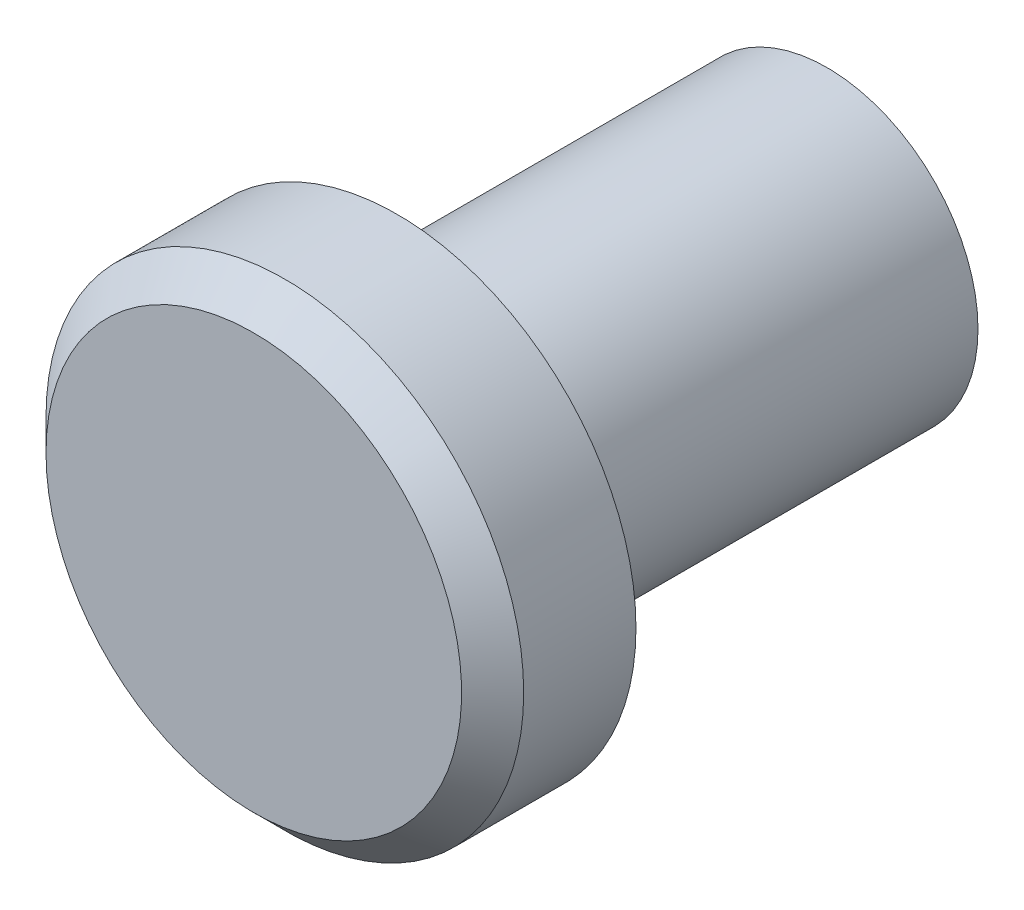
from build123d import *

# Parameters (mm, degrees)
CHAMFER1_SIZE = 0.8255


with BuildPart() as part:
    # Sketch1 → Revolve1 (revolve)
    with BuildSketch(Plane(origin=(0, 0, 0), x_dir=(0, 0, -1), z_dir=(1, 0, 0)), mode=Mode.PRIVATE) as revolve1_sk:
        Polygon((0, 0), (0, 6.35), (3.81, 6.35), (3.81, 4.0132), (15.24, 4.0132), (15.24, 2.921), (4.445, 2.921), (2.689886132, 0), align=None)
    revolve(revolve1_sk.sketch.rotate(Axis((0, 0, 0), (0, 0, -1)), 90), axis=Axis((0, 0, 0), (0, 0, -1)))

    # Chamfer1
    chamfer1_edges = [part.edges().sort_by_distance(p)[0] for p in [
        (-2.921, 0, -15.24),
        (-6.35, 0, 0),
    ]]
    chamfer(chamfer1_edges, length=CHAMFER1_SIZE)


solid = part.part
